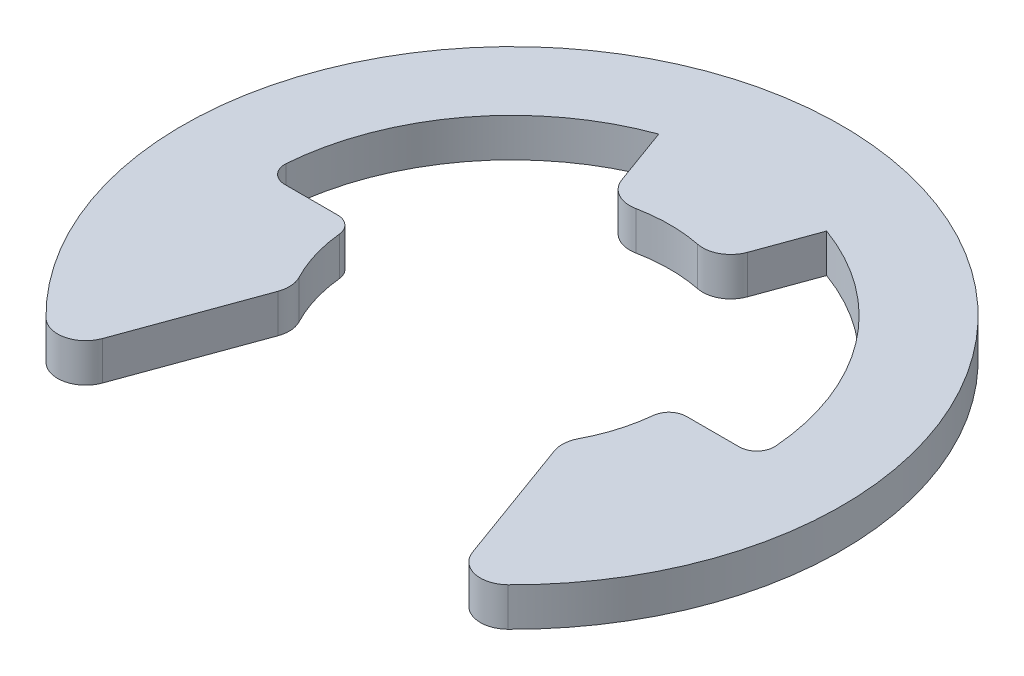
ISO-10303-21;
HEADER;
FILE_DESCRIPTION(('STEP AP214'),'2;1');
FILE_NAME('part.step','',(''),(''),'','','');
FILE_SCHEMA(('AUTOMOTIVE_DESIGN { 1 0 10303 214 1 1 1 1 }'));
ENDSEC;
DATA;
#1=APPLICATION_CONTEXT('core data for automotive mechanical design processes');
#2=APPLICATION_PROTOCOL_DEFINITION('international standard','automotive_design',2000,#1);
#3=PRODUCT_CONTEXT('',#1,'mechanical');
#4=PRODUCT('Part','Part','',(#3));
#5=PRODUCT_RELATED_PRODUCT_CATEGORY('part','',(#4));
#6=PRODUCT_DEFINITION_FORMATION('','',#4);
#7=PRODUCT_DEFINITION_CONTEXT('part definition',#1,'design');
#8=PRODUCT_DEFINITION('design','',#6,#7);
#9=PRODUCT_DEFINITION_SHAPE('','',#8);
#10=(LENGTH_UNIT() NAMED_UNIT(*) SI_UNIT(.MILLI.,.METRE.));
#11=(NAMED_UNIT(*) PLANE_ANGLE_UNIT() SI_UNIT($,.RADIAN.));
#12=(NAMED_UNIT(*) SI_UNIT($,.STERADIAN.) SOLID_ANGLE_UNIT());
#13=UNCERTAINTY_MEASURE_WITH_UNIT(LENGTH_MEASURE(1.E-05),#10,'distance_accuracy_value','');
#14=(GEOMETRIC_REPRESENTATION_CONTEXT(3) GLOBAL_UNCERTAINTY_ASSIGNED_CONTEXT((#13)) GLOBAL_UNIT_ASSIGNED_CONTEXT((#10,
#11,#12)) REPRESENTATION_CONTEXT('',''));
#15=CARTESIAN_POINT('',(0.,0.,0.));
#16=DIRECTION('',(0.,0.,1.));
#17=DIRECTION('',(1.,0.,0.));
#18=AXIS2_PLACEMENT_3D('',#15,#16,#17);
#19=CARTESIAN_POINT('',(0.,0.55,0.));
#20=DIRECTION('',(0.,-1.,0.));
#21=DIRECTION('',(0.,0.,-1.));
#22=AXIS2_PLACEMENT_3D('',#19,#20,#21);
#23=CYLINDRICAL_SURFACE('',#22,7.);
#24=CARTESIAN_POINT('',(0.,0.55,0.));
#25=DIRECTION('',(0.,-1.,0.));
#26=DIRECTION('',(0.,0.,1.));
#27=AXIS2_PLACEMENT_3D('',#24,#25,#26);
#28=CIRCLE('',#27,7.);
#29=CARTESIAN_POINT('',(-6.97925921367,0.55,-0.538461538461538));
#30=VERTEX_POINT('',#29);
#31=CARTESIAN_POINT('',(-2.39414100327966,0.55,-6.57784834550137));
#32=VERTEX_POINT('',#31);
#33=EDGE_CURVE('E187',#30,#32,#28,.T.);
#34=ORIENTED_EDGE('',*,*,#33,.F.);
#35=DIRECTION('',(0.,-1.,0.));
#36=VECTOR('',#35,1.);
#37=CARTESIAN_POINT('',(-6.97925921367,0.55,-0.538461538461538));
#38=LINE('',#37,#36);
#39=CARTESIAN_POINT('',(-6.97925921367,-0.55,-0.538461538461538));
#40=VERTEX_POINT('',#39);
#41=EDGE_CURVE('E327',#30,#40,#38,.T.);
#42=ORIENTED_EDGE('',*,*,#41,.T.);
#43=CARTESIAN_POINT('',(0.,-0.55,0.));
#44=DIRECTION('',(0.,-1.,0.));
#45=DIRECTION('',(0.,0.,1.));
#46=AXIS2_PLACEMENT_3D('',#43,#44,#45);
#47=CIRCLE('',#46,7.);
#48=CARTESIAN_POINT('',(-2.39414100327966,-0.55,-6.57784834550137));
#49=VERTEX_POINT('',#48);
#50=EDGE_CURVE('E211',#40,#49,#47,.T.);
#51=ORIENTED_EDGE('',*,*,#50,.T.);
#52=DIRECTION('',(0.,-1.,0.));
#53=VECTOR('',#52,1.);
#54=CARTESIAN_POINT('',(-2.39414100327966,0.55,-6.57784834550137));
#55=LINE('',#54,#53);
#56=EDGE_CURVE('E204',#32,#49,#55,.T.);
#57=ORIENTED_EDGE('',*,*,#56,.F.);
#58=EDGE_LOOP('',(#34,#42,#51,#57));
#59=FACE_BOUND('',#58,.T.);
#60=ADVANCED_FACE('F39',(#59),#23,.F.);
#61=CARTESIAN_POINT('',(-2.39414100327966,0.55,-6.57784834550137));
#62=DIRECTION('',(0.939692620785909,0.,-0.342020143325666));
#63=DIRECTION('',(-0.342020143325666,0.,-0.93969262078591));
#64=AXIS2_PLACEMENT_3D('',#61,#62,#63);
#65=PLANE('',#64);
#66=DIRECTION('',(0.342020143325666,0.,0.939692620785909));
#67=VECTOR('',#66,1.);
#68=CARTESIAN_POINT('',(-2.39414100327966,-0.55,-6.57784834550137));
#69=LINE('',#68,#67);
#70=CARTESIAN_POINT('',(-1.79193750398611,-0.55,-4.92330782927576));
#71=VERTEX_POINT('',#70);
#72=EDGE_CURVE('E447',#49,#71,#69,.T.);
#73=ORIENTED_EDGE('',*,*,#72,.T.);
#74=DIRECTION('',(0.,-1.,0.));
#75=VECTOR('',#74,1.);
#76=CARTESIAN_POINT('',(-1.79193750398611,0.55,-4.92330782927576));
#77=LINE('',#76,#75);
#78=CARTESIAN_POINT('',(-1.79193750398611,0.55,-4.92330782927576));
#79=VERTEX_POINT('',#78);
#80=EDGE_CURVE('E206',#71,#79,#77,.F.);
#81=ORIENTED_EDGE('',*,*,#80,.T.);
#82=DIRECTION('',(0.342020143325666,0.,0.939692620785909));
#83=VECTOR('',#82,1.);
#84=CARTESIAN_POINT('',(-2.39414100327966,0.55,-6.57784834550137));
#85=LINE('',#84,#83);
#86=EDGE_CURVE('E191',#32,#79,#85,.T.);
#87=ORIENTED_EDGE('',*,*,#86,.F.);
#88=ORIENTED_EDGE('',*,*,#56,.T.);
#89=EDGE_LOOP('',(#73,#81,#87,#88));
#90=FACE_BOUND('',#89,.T.);
#91=ADVANCED_FACE('F203',(#90),#65,.F.);
#92=CARTESIAN_POINT('',(0.,0.55,0.));
#93=DIRECTION('',(0.,-1.,0.));
#94=DIRECTION('',(0.,0.,-1.));
#95=AXIS2_PLACEMENT_3D('',#92,#93,#94);
#96=CYLINDRICAL_SURFACE('',#95,4.5);
#97=CARTESIAN_POINT('',(0.,-0.55,0.));
#98=DIRECTION('',(0.,-1.,0.));
#99=DIRECTION('',(0.,0.,1.));
#100=AXIS2_PLACEMENT_3D('',#97,#98,#99);
#101=CIRCLE('',#100,4.5);
#102=CARTESIAN_POINT('',(-0.883174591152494,-0.55,-4.41248259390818));
#103=VERTEX_POINT('',#102);
#104=CARTESIAN_POINT('',(0.883174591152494,-0.55,-4.41248259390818));
#105=VERTEX_POINT('',#104);
#106=EDGE_CURVE('E449',#103,#105,#101,.T.);
#107=ORIENTED_EDGE('',*,*,#106,.T.);
#108=DIRECTION('',(0.,-1.,0.));
#109=VECTOR('',#108,1.);
#110=CARTESIAN_POINT('',(0.883174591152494,0.55,-4.41248259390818));
#111=LINE('',#110,#109);
#112=CARTESIAN_POINT('',(0.883174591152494,0.55,-4.41248259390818));
#113=VERTEX_POINT('',#112);
#114=EDGE_CURVE('E291',#105,#113,#111,.F.);
#115=ORIENTED_EDGE('',*,*,#114,.T.);
#116=CARTESIAN_POINT('',(0.,0.55,0.));
#117=DIRECTION('',(0.,-1.,0.));
#118=DIRECTION('',(0.,0.,1.));
#119=AXIS2_PLACEMENT_3D('',#116,#117,#118);
#120=CIRCLE('',#119,4.5);
#121=CARTESIAN_POINT('',(-0.883174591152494,0.55,-4.41248259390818));
#122=VERTEX_POINT('',#121);
#123=EDGE_CURVE('E208',#122,#113,#120,.T.);
#124=ORIENTED_EDGE('',*,*,#123,.F.);
#125=DIRECTION('',(0.,-1.,0.));
#126=VECTOR('',#125,1.);
#127=CARTESIAN_POINT('',(-0.883174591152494,0.55,-4.41248259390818));
#128=LINE('',#127,#126);
#129=EDGE_CURVE('E287',#122,#103,#128,.T.);
#130=ORIENTED_EDGE('',*,*,#129,.T.);
#131=EDGE_LOOP('',(#107,#115,#124,#130));
#132=FACE_BOUND('',#131,.T.);
#133=ADVANCED_FACE('F371',(#132),#96,.F.);
#134=CARTESIAN_POINT('',(1.53909064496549,0.55,-4.22861679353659));
#135=DIRECTION('',(-0.939692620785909,0.,-0.342020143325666));
#136=DIRECTION('',(-0.342020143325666,0.,0.93969262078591));
#137=AXIS2_PLACEMENT_3D('',#134,#135,#136);
#138=PLANE('',#137);
#139=DIRECTION('',(0.342020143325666,0.,-0.939692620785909));
#140=VECTOR('',#139,1.);
#141=CARTESIAN_POINT('',(1.53909064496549,0.55,-4.22861679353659));
#142=LINE('',#141,#140);
#143=CARTESIAN_POINT('',(1.79193750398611,0.55,-4.92330782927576));
#144=VERTEX_POINT('',#143);
#145=CARTESIAN_POINT('',(2.39414100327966,0.55,-6.57784834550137));
#146=VERTEX_POINT('',#145);
#147=EDGE_CURVE('E424',#144,#146,#142,.T.);
#148=ORIENTED_EDGE('',*,*,#147,.F.);
#149=DIRECTION('',(0.,-1.,0.));
#150=VECTOR('',#149,1.);
#151=CARTESIAN_POINT('',(1.79193750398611,0.55,-4.92330782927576));
#152=LINE('',#151,#150);
#153=CARTESIAN_POINT('',(1.79193750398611,-0.55,-4.92330782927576));
#154=VERTEX_POINT('',#153);
#155=EDGE_CURVE('E283',#144,#154,#152,.T.);
#156=ORIENTED_EDGE('',*,*,#155,.T.);
#157=DIRECTION('',(0.342020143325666,0.,-0.939692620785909));
#158=VECTOR('',#157,1.);
#159=CARTESIAN_POINT('',(1.53909064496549,-0.55,-4.22861679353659));
#160=LINE('',#159,#158);
#161=CARTESIAN_POINT('',(2.39414100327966,-0.55,-6.57784834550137));
#162=VERTEX_POINT('',#161);
#163=EDGE_CURVE('E453',#154,#162,#160,.T.);
#164=ORIENTED_EDGE('',*,*,#163,.T.);
#165=DIRECTION('',(0.,-1.,0.));
#166=VECTOR('',#165,1.);
#167=CARTESIAN_POINT('',(2.39414100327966,0.55,-6.57784834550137));
#168=LINE('',#167,#166);
#169=EDGE_CURVE('E215',#146,#162,#168,.T.);
#170=ORIENTED_EDGE('',*,*,#169,.F.);
#171=EDGE_LOOP('',(#148,#156,#164,#170));
#172=FACE_BOUND('',#171,.T.);
#173=ADVANCED_FACE('F527',(#172),#138,.F.);
#174=CARTESIAN_POINT('',(0.,0.55,0.));
#175=DIRECTION('',(0.,-1.,0.));
#176=DIRECTION('',(0.,0.,-1.));
#177=AXIS2_PLACEMENT_3D('',#174,#175,#176);
#178=CYLINDRICAL_SURFACE('',#177,7.);
#179=CARTESIAN_POINT('',(0.,-0.55,0.));
#180=DIRECTION('',(0.,-1.,0.));
#181=DIRECTION('',(0.,0.,1.));
#182=AXIS2_PLACEMENT_3D('',#179,#180,#181);
#183=CIRCLE('',#182,7.);
#184=CARTESIAN_POINT('',(6.97925921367,-0.55,-0.538461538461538));
#185=VERTEX_POINT('',#184);
#186=EDGE_CURVE('E456',#162,#185,#183,.T.);
#187=ORIENTED_EDGE('',*,*,#186,.T.);
#188=DIRECTION('',(0.,-1.,0.));
#189=VECTOR('',#188,1.);
#190=CARTESIAN_POINT('',(6.97925921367,0.55,-0.538461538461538));
#191=LINE('',#190,#189);
#192=CARTESIAN_POINT('',(6.97925921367,0.55,-0.538461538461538));
#193=VERTEX_POINT('',#192);
#194=EDGE_CURVE('E309',#185,#193,#191,.F.);
#195=ORIENTED_EDGE('',*,*,#194,.T.);
#196=CARTESIAN_POINT('',(0.,0.55,0.));
#197=DIRECTION('',(0.,-1.,0.));
#198=DIRECTION('',(0.,0.,1.));
#199=AXIS2_PLACEMENT_3D('',#196,#197,#198);
#200=CIRCLE('',#199,7.);
#201=EDGE_CURVE('E411',#146,#193,#200,.T.);
#202=ORIENTED_EDGE('',*,*,#201,.F.);
#203=ORIENTED_EDGE('',*,*,#169,.T.);
#204=EDGE_LOOP('',(#187,#195,#202,#203));
#205=FACE_BOUND('',#204,.T.);
#206=ADVANCED_FACE('F521',(#205),#178,.F.);
#207=CARTESIAN_POINT('',(4.5,0.55,0.));
#208=DIRECTION('',(0.,0.,1.));
#209=DIRECTION('',(1.,0.,0.));
#210=AXIS2_PLACEMENT_3D('',#207,#208,#209);
#211=PLANE('',#210);
#212=DIRECTION('',(-1.,0.,0.));
#213=VECTOR('',#212,1.);
#214=CARTESIAN_POINT('',(4.5,0.55,0.));
#215=LINE('',#214,#213);
#216=CARTESIAN_POINT('',(6.48074069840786,0.55,0.));
#217=VERTEX_POINT('',#216);
#218=CARTESIAN_POINT('',(4.9749371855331,0.55,0.));
#219=VERTEX_POINT('',#218);
#220=EDGE_CURVE('E408',#217,#219,#215,.T.);
#221=ORIENTED_EDGE('',*,*,#220,.F.);
#222=DIRECTION('',(0.,1.,0.));
#223=VECTOR('',#222,1.);
#224=CARTESIAN_POINT('',(6.48074069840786,-0.55,0.));
#225=LINE('',#224,#223);
#226=CARTESIAN_POINT('',(6.48074069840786,-0.55,0.));
#227=VERTEX_POINT('',#226);
#228=EDGE_CURVE('E305',#217,#227,#225,.F.);
#229=ORIENTED_EDGE('',*,*,#228,.T.);
#230=DIRECTION('',(-1.,0.,0.));
#231=VECTOR('',#230,1.);
#232=CARTESIAN_POINT('',(4.5,-0.55,0.));
#233=LINE('',#232,#231);
#234=CARTESIAN_POINT('',(4.9749371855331,-0.55,0.));
#235=VERTEX_POINT('',#234);
#236=EDGE_CURVE('E460',#227,#235,#233,.T.);
#237=ORIENTED_EDGE('',*,*,#236,.T.);
#238=DIRECTION('',(0.,-1.,0.));
#239=VECTOR('',#238,1.);
#240=CARTESIAN_POINT('',(4.9749371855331,0.55,0.));
#241=LINE('',#240,#239);
#242=EDGE_CURVE('E303',#235,#219,#241,.F.);
#243=ORIENTED_EDGE('',*,*,#242,.T.);
#244=EDGE_LOOP('',(#221,#229,#237,#243));
#245=FACE_BOUND('',#244,.T.);
#246=ADVANCED_FACE('F413',(#245),#211,.F.);
#247=CARTESIAN_POINT('',(0.,0.55,0.));
#248=DIRECTION('',(0.,-1.,0.));
#249=DIRECTION('',(0.,0.,-1.));
#250=AXIS2_PLACEMENT_3D('',#247,#248,#249);
#251=CYLINDRICAL_SURFACE('',#250,4.5);
#252=CARTESIAN_POINT('',(0.,0.55,0.));
#253=DIRECTION('',(0.,-1.,0.));
#254=DIRECTION('',(0.,0.,1.));
#255=AXIS2_PLACEMENT_3D('',#252,#253,#254);
#256=CIRCLE('',#255,4.5);
#257=CARTESIAN_POINT('',(4.47744346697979,0.55,0.45));
#258=VERTEX_POINT('',#257);
#259=CARTESIAN_POINT('',(3.98517922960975,0.55,2.09005897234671));
#260=VERTEX_POINT('',#259);
#261=EDGE_CURVE('E418',#258,#260,#256,.T.);
#262=ORIENTED_EDGE('',*,*,#261,.F.);
#263=DIRECTION('',(0.,-1.,0.));
#264=VECTOR('',#263,1.);
#265=CARTESIAN_POINT('',(4.47744346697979,0.55,0.45));
#266=LINE('',#265,#264);
#267=CARTESIAN_POINT('',(4.47744346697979,-0.55,0.45));
#268=VERTEX_POINT('',#267);
#269=EDGE_CURVE('E312',#258,#268,#266,.T.);
#270=ORIENTED_EDGE('',*,*,#269,.T.);
#271=CARTESIAN_POINT('',(0.,-0.55,0.));
#272=DIRECTION('',(0.,-1.,0.));
#273=DIRECTION('',(0.,0.,1.));
#274=AXIS2_PLACEMENT_3D('',#271,#272,#273);
#275=CIRCLE('',#274,4.5);
#276=CARTESIAN_POINT('',(3.98517922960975,-0.55,2.09005897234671));
#277=VERTEX_POINT('',#276);
#278=EDGE_CURVE('E463',#268,#277,#275,.T.);
#279=ORIENTED_EDGE('',*,*,#278,.T.);
#280=DIRECTION('',(0.,-1.,0.));
#281=VECTOR('',#280,1.);
#282=CARTESIAN_POINT('',(3.98517922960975,0.55,2.09005897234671));
#283=LINE('',#282,#281);
#284=EDGE_CURVE('E250',#277,#260,#283,.F.);
#285=ORIENTED_EDGE('',*,*,#284,.T.);
#286=EDGE_LOOP('',(#262,#270,#279,#285));
#287=FACE_BOUND('',#286,.T.);
#288=ADVANCED_FACE('F512',(#287),#251,.F.);
#289=CARTESIAN_POINT('',(3.81499999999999,0.55,2.38658228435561));
#290=DIRECTION('',(0.939692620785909,0.,-0.342020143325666));
#291=DIRECTION('',(-0.342020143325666,0.,-0.939692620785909));
#292=AXIS2_PLACEMENT_3D('',#289,#290,#291);
#293=PLANE('',#292);
#294=DIRECTION('',(0.342020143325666,0.,0.939692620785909));
#295=VECTOR('',#294,1.);
#296=CARTESIAN_POINT('',(3.81499999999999,0.55,2.38658228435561));
#297=LINE('',#296,#295);
#298=CARTESIAN_POINT('',(3.94190144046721,0.55,2.73524112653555));
#299=VERTEX_POINT('',#298);
#300=CARTESIAN_POINT('',(5.27787312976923,0.55,6.40579317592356));
#301=VERTEX_POINT('',#300);
#302=EDGE_CURVE('E421',#299,#301,#297,.T.);
#303=ORIENTED_EDGE('',*,*,#302,.F.);
#304=DIRECTION('',(0.,-1.,0.));
#305=VECTOR('',#304,1.);
#306=CARTESIAN_POINT('',(3.94190144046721,0.55,2.73524112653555));
#307=LINE('',#306,#305);
#308=CARTESIAN_POINT('',(3.94190144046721,-0.55,2.73524112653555));
#309=VERTEX_POINT('',#308);
#310=EDGE_CURVE('E220',#299,#309,#307,.T.);
#311=ORIENTED_EDGE('',*,*,#310,.T.);
#312=DIRECTION('',(0.342020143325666,0.,0.939692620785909));
#313=VECTOR('',#312,1.);
#314=CARTESIAN_POINT('',(3.81499999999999,-0.55,2.38658228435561));
#315=LINE('',#314,#313);
#316=CARTESIAN_POINT('',(5.27787312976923,-0.55,6.40579317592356));
#317=VERTEX_POINT('',#316);
#318=EDGE_CURVE('E466',#309,#317,#315,.T.);
#319=ORIENTED_EDGE('',*,*,#318,.T.);
#320=DIRECTION('',(0.,-1.,0.));
#321=VECTOR('',#320,1.);
#322=CARTESIAN_POINT('',(5.27787312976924,0.55,6.40579317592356));
#323=LINE('',#322,#321);
#324=EDGE_CURVE('E214',#317,#301,#323,.F.);
#325=ORIENTED_EDGE('',*,*,#324,.T.);
#326=EDGE_LOOP('',(#303,#311,#319,#325));
#327=FACE_BOUND('',#326,.T.);
#328=ADVANCED_FACE('F506',(#327),#293,.F.);
#329=CARTESIAN_POINT('',(0.,0.55,0.));
#330=DIRECTION('',(0.,-1.,0.));
#331=DIRECTION('',(0.,0.,-1.));
#332=AXIS2_PLACEMENT_3D('',#329,#330,#331);
#333=CYLINDRICAL_SURFACE('',#332,9.4);
#334=CARTESIAN_POINT('',(0.,0.55,0.));
#335=DIRECTION('',(0.,1.,0.));
#336=DIRECTION('',(0.,0.,1.));
#337=AXIS2_PLACEMENT_3D('',#334,#335,#336);
#338=CIRCLE('',#337,9.4);
#339=CARTESIAN_POINT('',(6.59052278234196,0.55,6.70261213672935));
#340=VERTEX_POINT('',#339);
#341=CARTESIAN_POINT('',(-6.590522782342,0.55,6.70261213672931));
#342=VERTEX_POINT('',#341);
#343=EDGE_CURVE('E431',#340,#342,#338,.T.);
#344=ORIENTED_EDGE('',*,*,#343,.F.);
#345=DIRECTION('',(0.,-1.,0.));
#346=VECTOR('',#345,1.);
#347=CARTESIAN_POINT('',(6.59052278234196,0.55,6.70261213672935));
#348=LINE('',#347,#346);
#349=CARTESIAN_POINT('',(6.59052278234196,-0.55,6.70261213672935));
#350=VERTEX_POINT('',#349);
#351=EDGE_CURVE('E299',#340,#350,#348,.T.);
#352=ORIENTED_EDGE('',*,*,#351,.T.);
#353=CARTESIAN_POINT('',(0.,-0.55,0.));
#354=DIRECTION('',(0.,1.,0.));
#355=DIRECTION('',(0.,0.,1.));
#356=AXIS2_PLACEMENT_3D('',#353,#354,#355);
#357=CIRCLE('',#356,9.4);
#358=CARTESIAN_POINT('',(-6.590522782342,-0.55,6.70261213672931));
#359=VERTEX_POINT('',#358);
#360=EDGE_CURVE('E470',#350,#359,#357,.T.);
#361=ORIENTED_EDGE('',*,*,#360,.T.);
#362=DIRECTION('',(0.,-1.,0.));
#363=VECTOR('',#362,1.);
#364=CARTESIAN_POINT('',(-6.590522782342,0.55,6.70261213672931));
#365=LINE('',#364,#363);
#366=EDGE_CURVE('E296',#359,#342,#365,.F.);
#367=ORIENTED_EDGE('',*,*,#366,.T.);
#368=EDGE_LOOP('',(#344,#352,#361,#367));
#369=FACE_BOUND('',#368,.T.);
#370=ADVANCED_FACE('F499',(#369),#333,.T.);
#371=CARTESIAN_POINT('',(-5.67406753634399,0.55,7.49432836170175));
#372=DIRECTION('',(-0.939692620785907,0.,-0.342020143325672));
#373=DIRECTION('',(-0.342020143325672,0.,0.939692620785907));
#374=AXIS2_PLACEMENT_3D('',#371,#372,#373);
#375=PLANE('',#374);
#376=DIRECTION('',(0.342020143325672,0.,-0.939692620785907));
#377=VECTOR('',#376,1.);
#378=CARTESIAN_POINT('',(-5.67406753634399,-0.55,7.49432836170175));
#379=LINE('',#378,#377);
#380=CARTESIAN_POINT('',(-5.27787312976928,-0.55,6.40579317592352));
#381=VERTEX_POINT('',#380);
#382=CARTESIAN_POINT('',(-3.94190144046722,-0.55,2.73524112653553));
#383=VERTEX_POINT('',#382);
#384=EDGE_CURVE('E474',#381,#383,#379,.T.);
#385=ORIENTED_EDGE('',*,*,#384,.T.);
#386=DIRECTION('',(0.,-1.,0.));
#387=VECTOR('',#386,1.);
#388=CARTESIAN_POINT('',(-3.94190144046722,0.55,2.73524112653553));
#389=LINE('',#388,#387);
#390=CARTESIAN_POINT('',(-3.94190144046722,0.55,2.73524112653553));
#391=VERTEX_POINT('',#390);
#392=EDGE_CURVE('E280',#383,#391,#389,.F.);
#393=ORIENTED_EDGE('',*,*,#392,.T.);
#394=DIRECTION('',(0.342020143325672,0.,-0.939692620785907));
#395=VECTOR('',#394,1.);
#396=CARTESIAN_POINT('',(-5.67406753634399,0.55,7.49432836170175));
#397=LINE('',#396,#395);
#398=CARTESIAN_POINT('',(-5.27787312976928,0.55,6.40579317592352));
#399=VERTEX_POINT('',#398);
#400=EDGE_CURVE('E435',#399,#391,#397,.T.);
#401=ORIENTED_EDGE('',*,*,#400,.F.);
#402=DIRECTION('',(0.,-1.,0.));
#403=VECTOR('',#402,1.);
#404=CARTESIAN_POINT('',(-5.27787312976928,0.55,6.40579317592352));
#405=LINE('',#404,#403);
#406=EDGE_CURVE('E276',#399,#381,#405,.T.);
#407=ORIENTED_EDGE('',*,*,#406,.T.);
#408=EDGE_LOOP('',(#385,#393,#401,#407));
#409=FACE_BOUND('',#408,.T.);
#410=ADVANCED_FACE('F491',(#409),#375,.F.);
#411=CARTESIAN_POINT('',(0.,0.55,0.));
#412=DIRECTION('',(0.,-1.,0.));
#413=DIRECTION('',(0.,0.,-1.));
#414=AXIS2_PLACEMENT_3D('',#411,#412,#413);
#415=CYLINDRICAL_SURFACE('',#414,4.5);
#416=CARTESIAN_POINT('',(0.,-0.55,0.));
#417=DIRECTION('',(0.,-1.,0.));
#418=DIRECTION('',(0.,0.,1.));
#419=AXIS2_PLACEMENT_3D('',#416,#417,#418);
#420=CIRCLE('',#419,4.5);
#421=CARTESIAN_POINT('',(-3.98517922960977,-0.55,2.09005897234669));
#422=VERTEX_POINT('',#421);
#423=CARTESIAN_POINT('',(-4.47744346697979,-0.55,0.45));
#424=VERTEX_POINT('',#423);
#425=EDGE_CURVE('E354',#422,#424,#420,.T.);
#426=ORIENTED_EDGE('',*,*,#425,.T.);
#427=DIRECTION('',(0.,-1.,0.));
#428=VECTOR('',#427,1.);
#429=CARTESIAN_POINT('',(-4.47744346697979,0.55,0.45));
#430=LINE('',#429,#428);
#431=CARTESIAN_POINT('',(-4.47744346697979,0.55,0.45));
#432=VERTEX_POINT('',#431);
#433=EDGE_CURVE('E336',#424,#432,#430,.F.);
#434=ORIENTED_EDGE('',*,*,#433,.T.);
#435=CARTESIAN_POINT('',(0.,0.55,0.));
#436=DIRECTION('',(0.,-1.,0.));
#437=DIRECTION('',(0.,0.,1.));
#438=AXIS2_PLACEMENT_3D('',#435,#436,#437);
#439=CIRCLE('',#438,4.5);
#440=CARTESIAN_POINT('',(-3.98517922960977,0.55,2.09005897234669));
#441=VERTEX_POINT('',#440);
#442=EDGE_CURVE('E439',#441,#432,#439,.T.);
#443=ORIENTED_EDGE('',*,*,#442,.F.);
#444=DIRECTION('',(0.,-1.,0.));
#445=VECTOR('',#444,1.);
#446=CARTESIAN_POINT('',(-3.98517922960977,0.55,2.09005897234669));
#447=LINE('',#446,#445);
#448=EDGE_CURVE('E272',#441,#422,#447,.T.);
#449=ORIENTED_EDGE('',*,*,#448,.T.);
#450=EDGE_LOOP('',(#426,#434,#443,#449));
#451=FACE_BOUND('',#450,.T.);
#452=ADVANCED_FACE('F483',(#451),#415,.F.);
#453=CARTESIAN_POINT('',(-4.5,0.55,0.));
#454=DIRECTION('',(0.,0.,1.));
#455=DIRECTION('',(1.,0.,0.));
#456=AXIS2_PLACEMENT_3D('',#453,#454,#455);
#457=PLANE('',#456);
#458=DIRECTION('',(-1.,0.,0.));
#459=VECTOR('',#458,1.);
#460=CARTESIAN_POINT('',(-4.5,-0.55,0.));
#461=LINE('',#460,#459);
#462=CARTESIAN_POINT('',(-4.9749371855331,-0.55,0.));
#463=VERTEX_POINT('',#462);
#464=CARTESIAN_POINT('',(-6.48074069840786,-0.55,0.));
#465=VERTEX_POINT('',#464);
#466=EDGE_CURVE('E198',#463,#465,#461,.T.);
#467=ORIENTED_EDGE('',*,*,#466,.T.);
#468=DIRECTION('',(0.,1.,0.));
#469=VECTOR('',#468,1.);
#470=CARTESIAN_POINT('',(-6.48074069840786,0.55,0.));
#471=LINE('',#470,#469);
#472=CARTESIAN_POINT('',(-6.48074069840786,0.55,0.));
#473=VERTEX_POINT('',#472);
#474=EDGE_CURVE('E61',#465,#473,#471,.T.);
#475=ORIENTED_EDGE('',*,*,#474,.T.);
#476=DIRECTION('',(-1.,0.,0.));
#477=VECTOR('',#476,1.);
#478=CARTESIAN_POINT('',(-4.5,0.55,0.));
#479=LINE('',#478,#477);
#480=CARTESIAN_POINT('',(-4.9749371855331,0.55,0.));
#481=VERTEX_POINT('',#480);
#482=EDGE_CURVE('E224',#481,#473,#479,.T.);
#483=ORIENTED_EDGE('',*,*,#482,.F.);
#484=DIRECTION('',(0.,-1.,0.));
#485=VECTOR('',#484,1.);
#486=CARTESIAN_POINT('',(-4.9749371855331,0.55,0.));
#487=LINE('',#486,#485);
#488=EDGE_CURVE('E330',#481,#463,#487,.T.);
#489=ORIENTED_EDGE('',*,*,#488,.T.);
#490=EDGE_LOOP('',(#467,#475,#483,#489));
#491=FACE_BOUND('',#490,.T.);
#492=ADVANCED_FACE('F351',(#491),#457,.F.);
#493=CARTESIAN_POINT('',(0.,0.55,0.));
#494=DIRECTION('',(0.,1.,0.));
#495=DIRECTION('',(0.,0.,1.));
#496=AXIS2_PLACEMENT_3D('',#493,#494,#495);
#497=PLANE('',#496);
#498=ORIENTED_EDGE('',*,*,#220,.T.);
#499=CARTESIAN_POINT('',(4.9749371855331,0.55,0.5));
#500=DIRECTION('',(0.,1.,0.));
#501=DIRECTION('',(0.,0.,1.));
#502=AXIS2_PLACEMENT_3D('',#499,#500,#501);
#503=CIRCLE('',#502,0.5);
#504=EDGE_CURVE('E324',#219,#258,#503,.T.);
#505=ORIENTED_EDGE('',*,*,#504,.T.);
#506=ORIENTED_EDGE('',*,*,#261,.T.);
#507=CARTESIAN_POINT('',(4.69365553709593,0.55,2.46162501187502));
#508=DIRECTION('',(0.,1.,0.));
#509=DIRECTION('',(0.,0.,1.));
#510=AXIS2_PLACEMENT_3D('',#507,#508,#509);
#511=CIRCLE('',#510,0.8);
#512=EDGE_CURVE('E269',#260,#299,#511,.T.);
#513=ORIENTED_EDGE('',*,*,#512,.T.);
#514=ORIENTED_EDGE('',*,*,#302,.T.);
#515=CARTESIAN_POINT('',(6.02962722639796,0.55,6.13217706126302));
#516=DIRECTION('',(0.,1.,0.));
#517=DIRECTION('',(0.,0.,1.));
#518=AXIS2_PLACEMENT_3D('',#515,#516,#517);
#519=CIRCLE('',#518,0.8);
#520=EDGE_CURVE('E257',#301,#340,#519,.T.);
#521=ORIENTED_EDGE('',*,*,#520,.T.);
#522=ORIENTED_EDGE('',*,*,#343,.T.);
#523=CARTESIAN_POINT('',(-6.029627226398,0.55,6.13217706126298));
#524=DIRECTION('',(0.,1.,0.));
#525=DIRECTION('',(0.,0.,1.));
#526=AXIS2_PLACEMENT_3D('',#523,#524,#525);
#527=CIRCLE('',#526,0.8);
#528=EDGE_CURVE('E254',#342,#399,#527,.T.);
#529=ORIENTED_EDGE('',*,*,#528,.T.);
#530=ORIENTED_EDGE('',*,*,#400,.T.);
#531=CARTESIAN_POINT('',(-4.69365553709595,0.55,2.46162501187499));
#532=DIRECTION('',(0.,1.,0.));
#533=DIRECTION('',(0.,0.,1.));
#534=AXIS2_PLACEMENT_3D('',#531,#532,#533);
#535=CIRCLE('',#534,0.8);
#536=EDGE_CURVE('E266',#391,#441,#535,.T.);
#537=ORIENTED_EDGE('',*,*,#536,.T.);
#538=ORIENTED_EDGE('',*,*,#442,.T.);
#539=CARTESIAN_POINT('',(-4.9749371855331,0.55,0.5));
#540=DIRECTION('',(0.,1.,0.));
#541=DIRECTION('',(0.,0.,1.));
#542=AXIS2_PLACEMENT_3D('',#539,#540,#541);
#543=CIRCLE('',#542,0.5);
#544=EDGE_CURVE('E322',#432,#481,#543,.T.);
#545=ORIENTED_EDGE('',*,*,#544,.T.);
#546=ORIENTED_EDGE('',*,*,#482,.T.);
#547=CARTESIAN_POINT('',(-6.48074069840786,0.55,-0.5));
#548=DIRECTION('',(0.,1.,0.));
#549=DIRECTION('',(0.,0.,1.));
#550=AXIS2_PLACEMENT_3D('',#547,#548,#549);
#551=CIRCLE('',#550,0.5);
#552=EDGE_CURVE('E11',#473,#30,#551,.F.);
#553=ORIENTED_EDGE('',*,*,#552,.T.);
#554=ORIENTED_EDGE('',*,*,#33,.T.);
#555=ORIENTED_EDGE('',*,*,#86,.T.);
#556=CARTESIAN_POINT('',(-1.04018340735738,0.55,-5.1969239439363));
#557=DIRECTION('',(0.,1.,0.));
#558=DIRECTION('',(0.,0.,1.));
#559=AXIS2_PLACEMENT_3D('',#556,#557,#558);
#560=CIRCLE('',#559,0.8);
#561=EDGE_CURVE('E260',#79,#122,#560,.T.);
#562=ORIENTED_EDGE('',*,*,#561,.T.);
#563=ORIENTED_EDGE('',*,*,#123,.T.);
#564=CARTESIAN_POINT('',(1.04018340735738,0.55,-5.1969239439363));
#565=DIRECTION('',(0.,1.,0.));
#566=DIRECTION('',(0.,0.,1.));
#567=AXIS2_PLACEMENT_3D('',#564,#565,#566);
#568=CIRCLE('',#567,0.8);
#569=EDGE_CURVE('E263',#113,#144,#568,.T.);
#570=ORIENTED_EDGE('',*,*,#569,.T.);
#571=ORIENTED_EDGE('',*,*,#147,.T.);
#572=ORIENTED_EDGE('',*,*,#201,.T.);
#573=CARTESIAN_POINT('',(6.48074069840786,0.55,-0.5));
#574=DIRECTION('',(0.,1.,0.));
#575=DIRECTION('',(0.,0.,1.));
#576=AXIS2_PLACEMENT_3D('',#573,#574,#575);
#577=CIRCLE('',#576,0.5);
#578=EDGE_CURVE('E342',#193,#217,#577,.F.);
#579=ORIENTED_EDGE('',*,*,#578,.T.);
#580=EDGE_LOOP('',(#498,#505,#506,#513,#514,#521,#522,#529,#530,#537,#538,#545,#546,#553,#554,
#555,#562,#563,#570,#571,#572,#579));
#581=FACE_BOUND('',#580,.T.);
#582=ADVANCED_FACE('F190',(#581),#497,.T.);
#583=CARTESIAN_POINT('',(0.,-0.55,0.));
#584=DIRECTION('',(0.,1.,0.));
#585=DIRECTION('',(0.,0.,1.));
#586=AXIS2_PLACEMENT_3D('',#583,#584,#585);
#587=PLANE('',#586);
#588=ORIENTED_EDGE('',*,*,#278,.F.);
#589=CARTESIAN_POINT('',(4.9749371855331,-0.55,0.5));
#590=DIRECTION('',(0.,1.,0.));
#591=DIRECTION('',(0.,0.,1.));
#592=AXIS2_PLACEMENT_3D('',#589,#590,#591);
#593=CIRCLE('',#592,0.5);
#594=EDGE_CURVE('E319',#268,#235,#593,.F.);
#595=ORIENTED_EDGE('',*,*,#594,.T.);
#596=ORIENTED_EDGE('',*,*,#236,.F.);
#597=CARTESIAN_POINT('',(6.48074069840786,-0.55,-0.5));
#598=DIRECTION('',(0.,1.,0.));
#599=DIRECTION('',(0.,0.,1.));
#600=AXIS2_PLACEMENT_3D('',#597,#598,#599);
#601=CIRCLE('',#600,0.5);
#602=EDGE_CURVE('E339',#227,#185,#601,.T.);
#603=ORIENTED_EDGE('',*,*,#602,.T.);
#604=ORIENTED_EDGE('',*,*,#186,.F.);
#605=ORIENTED_EDGE('',*,*,#163,.F.);
#606=CARTESIAN_POINT('',(1.04018340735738,-0.55,-5.1969239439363));
#607=DIRECTION('',(0.,1.,0.));
#608=DIRECTION('',(0.,0.,1.));
#609=AXIS2_PLACEMENT_3D('',#606,#607,#608);
#610=CIRCLE('',#609,0.8);
#611=EDGE_CURVE('E240',#154,#105,#610,.F.);
#612=ORIENTED_EDGE('',*,*,#611,.T.);
#613=ORIENTED_EDGE('',*,*,#106,.F.);
#614=CARTESIAN_POINT('',(-1.04018340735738,-0.55,-5.1969239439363));
#615=DIRECTION('',(0.,1.,0.));
#616=DIRECTION('',(0.,0.,1.));
#617=AXIS2_PLACEMENT_3D('',#614,#615,#616);
#618=CIRCLE('',#617,0.8);
#619=EDGE_CURVE('E237',#103,#71,#618,.F.);
#620=ORIENTED_EDGE('',*,*,#619,.T.);
#621=ORIENTED_EDGE('',*,*,#72,.F.);
#622=ORIENTED_EDGE('',*,*,#50,.F.);
#623=CARTESIAN_POINT('',(-6.48074069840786,-0.55,-0.5));
#624=DIRECTION('',(0.,1.,0.));
#625=DIRECTION('',(0.,0.,1.));
#626=AXIS2_PLACEMENT_3D('',#623,#624,#625);
#627=CIRCLE('',#626,0.5);
#628=EDGE_CURVE('E48',#40,#465,#627,.T.);
#629=ORIENTED_EDGE('',*,*,#628,.T.);
#630=ORIENTED_EDGE('',*,*,#466,.F.);
#631=CARTESIAN_POINT('',(-4.9749371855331,-0.55,0.5));
#632=DIRECTION('',(0.,1.,0.));
#633=DIRECTION('',(0.,0.,1.));
#634=AXIS2_PLACEMENT_3D('',#631,#632,#633);
#635=CIRCLE('',#634,0.5);
#636=EDGE_CURVE('E316',#463,#424,#635,.F.);
#637=ORIENTED_EDGE('',*,*,#636,.T.);
#638=ORIENTED_EDGE('',*,*,#425,.F.);
#639=CARTESIAN_POINT('',(-4.69365553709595,-0.55,2.46162501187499));
#640=DIRECTION('',(0.,1.,0.));
#641=DIRECTION('',(0.,0.,1.));
#642=AXIS2_PLACEMENT_3D('',#639,#640,#641);
#643=CIRCLE('',#642,0.8);
#644=EDGE_CURVE('E243',#422,#383,#643,.F.);
#645=ORIENTED_EDGE('',*,*,#644,.T.);
#646=ORIENTED_EDGE('',*,*,#384,.F.);
#647=CARTESIAN_POINT('',(-6.029627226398,-0.55,6.13217706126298));
#648=DIRECTION('',(0.,1.,0.));
#649=DIRECTION('',(0.,0.,1.));
#650=AXIS2_PLACEMENT_3D('',#647,#648,#649);
#651=CIRCLE('',#650,0.8);
#652=EDGE_CURVE('E231',#381,#359,#651,.F.);
#653=ORIENTED_EDGE('',*,*,#652,.T.);
#654=ORIENTED_EDGE('',*,*,#360,.F.);
#655=CARTESIAN_POINT('',(6.02962722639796,-0.55,6.13217706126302));
#656=DIRECTION('',(0.,1.,0.));
#657=DIRECTION('',(0.,0.,1.));
#658=AXIS2_PLACEMENT_3D('',#655,#656,#657);
#659=CIRCLE('',#658,0.8);
#660=EDGE_CURVE('E234',#350,#317,#659,.F.);
#661=ORIENTED_EDGE('',*,*,#660,.T.);
#662=ORIENTED_EDGE('',*,*,#318,.F.);
#663=CARTESIAN_POINT('',(4.69365553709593,-0.55,2.46162501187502));
#664=DIRECTION('',(0.,1.,0.));
#665=DIRECTION('',(0.,0.,1.));
#666=AXIS2_PLACEMENT_3D('',#663,#664,#665);
#667=CIRCLE('',#666,0.8);
#668=EDGE_CURVE('E246',#309,#277,#667,.F.);
#669=ORIENTED_EDGE('',*,*,#668,.T.);
#670=EDGE_LOOP('',(#588,#595,#596,#603,#604,#605,#612,#613,#620,#621,#622,#629,#630,#637,#638,
#645,#646,#653,#654,#661,#662,#669));
#671=FACE_BOUND('',#670,.T.);
#672=ADVANCED_FACE('F349',(#671),#587,.F.);
#673=CARTESIAN_POINT('',(4.69365553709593,0.55,2.46162501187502));
#674=DIRECTION('',(0.,-1.,0.));
#675=DIRECTION('',(0.,0.,-1.));
#676=AXIS2_PLACEMENT_3D('',#673,#674,#675);
#677=CYLINDRICAL_SURFACE('',#676,0.8);
#678=ORIENTED_EDGE('',*,*,#512,.F.);
#679=ORIENTED_EDGE('',*,*,#284,.F.);
#680=ORIENTED_EDGE('',*,*,#668,.F.);
#681=ORIENTED_EDGE('',*,*,#310,.F.);
#682=EDGE_LOOP('',(#678,#679,#680,#681));
#683=FACE_BOUND('',#682,.T.);
#684=ADVANCED_FACE('F375',(#683),#677,.T.);
#685=CARTESIAN_POINT('',(-4.69365553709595,0.55,2.46162501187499));
#686=DIRECTION('',(0.,-1.,0.));
#687=DIRECTION('',(0.,0.,-1.));
#688=AXIS2_PLACEMENT_3D('',#685,#686,#687);
#689=CYLINDRICAL_SURFACE('',#688,0.8);
#690=ORIENTED_EDGE('',*,*,#536,.F.);
#691=ORIENTED_EDGE('',*,*,#392,.F.);
#692=ORIENTED_EDGE('',*,*,#644,.F.);
#693=ORIENTED_EDGE('',*,*,#448,.F.);
#694=EDGE_LOOP('',(#690,#691,#692,#693));
#695=FACE_BOUND('',#694,.T.);
#696=ADVANCED_FACE('F378',(#695),#689,.T.);
#697=CARTESIAN_POINT('',(1.04018340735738,0.55,-5.1969239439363));
#698=DIRECTION('',(0.,-1.,0.));
#699=DIRECTION('',(0.,0.,-1.));
#700=AXIS2_PLACEMENT_3D('',#697,#698,#699);
#701=CYLINDRICAL_SURFACE('',#700,0.8);
#702=ORIENTED_EDGE('',*,*,#569,.F.);
#703=ORIENTED_EDGE('',*,*,#114,.F.);
#704=ORIENTED_EDGE('',*,*,#611,.F.);
#705=ORIENTED_EDGE('',*,*,#155,.F.);
#706=EDGE_LOOP('',(#702,#703,#704,#705));
#707=FACE_BOUND('',#706,.T.);
#708=ADVANCED_FACE('F382',(#707),#701,.T.);
#709=CARTESIAN_POINT('',(-1.04018340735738,0.55,-5.1969239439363));
#710=DIRECTION('',(0.,-1.,0.));
#711=DIRECTION('',(0.,0.,-1.));
#712=AXIS2_PLACEMENT_3D('',#709,#710,#711);
#713=CYLINDRICAL_SURFACE('',#712,0.8);
#714=ORIENTED_EDGE('',*,*,#561,.F.);
#715=ORIENTED_EDGE('',*,*,#80,.F.);
#716=ORIENTED_EDGE('',*,*,#619,.F.);
#717=ORIENTED_EDGE('',*,*,#129,.F.);
#718=EDGE_LOOP('',(#714,#715,#716,#717));
#719=FACE_BOUND('',#718,.T.);
#720=ADVANCED_FACE('F386',(#719),#713,.T.);
#721=CARTESIAN_POINT('',(6.02962722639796,0.55,6.13217706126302));
#722=DIRECTION('',(0.,-1.,0.));
#723=DIRECTION('',(0.,0.,-1.));
#724=AXIS2_PLACEMENT_3D('',#721,#722,#723);
#725=CYLINDRICAL_SURFACE('',#724,0.8);
#726=ORIENTED_EDGE('',*,*,#520,.F.);
#727=ORIENTED_EDGE('',*,*,#324,.F.);
#728=ORIENTED_EDGE('',*,*,#660,.F.);
#729=ORIENTED_EDGE('',*,*,#351,.F.);
#730=EDGE_LOOP('',(#726,#727,#728,#729));
#731=FACE_BOUND('',#730,.T.);
#732=ADVANCED_FACE('F390',(#731),#725,.T.);
#733=CARTESIAN_POINT('',(-6.029627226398,0.55,6.13217706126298));
#734=DIRECTION('',(0.,-1.,0.));
#735=DIRECTION('',(0.,0.,-1.));
#736=AXIS2_PLACEMENT_3D('',#733,#734,#735);
#737=CYLINDRICAL_SURFACE('',#736,0.8);
#738=ORIENTED_EDGE('',*,*,#528,.F.);
#739=ORIENTED_EDGE('',*,*,#366,.F.);
#740=ORIENTED_EDGE('',*,*,#652,.F.);
#741=ORIENTED_EDGE('',*,*,#406,.F.);
#742=EDGE_LOOP('',(#738,#739,#740,#741));
#743=FACE_BOUND('',#742,.T.);
#744=ADVANCED_FACE('F394',(#743),#737,.T.);
#745=CARTESIAN_POINT('',(6.48074069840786,0.55,-0.5));
#746=DIRECTION('',(0.,-1.,0.));
#747=DIRECTION('',(0.,0.,-1.));
#748=AXIS2_PLACEMENT_3D('',#745,#746,#747);
#749=CYLINDRICAL_SURFACE('',#748,0.5);
#750=ORIENTED_EDGE('',*,*,#578,.F.);
#751=ORIENTED_EDGE('',*,*,#194,.F.);
#752=ORIENTED_EDGE('',*,*,#602,.F.);
#753=ORIENTED_EDGE('',*,*,#228,.F.);
#754=EDGE_LOOP('',(#750,#751,#752,#753));
#755=FACE_BOUND('',#754,.T.);
#756=ADVANCED_FACE('F363',(#755),#749,.F.);
#757=CARTESIAN_POINT('',(4.9749371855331,0.55,0.5));
#758=DIRECTION('',(0.,-1.,0.));
#759=DIRECTION('',(0.,0.,-1.));
#760=AXIS2_PLACEMENT_3D('',#757,#758,#759);
#761=CYLINDRICAL_SURFACE('',#760,0.5);
#762=ORIENTED_EDGE('',*,*,#504,.F.);
#763=ORIENTED_EDGE('',*,*,#242,.F.);
#764=ORIENTED_EDGE('',*,*,#594,.F.);
#765=ORIENTED_EDGE('',*,*,#269,.F.);
#766=EDGE_LOOP('',(#762,#763,#764,#765));
#767=FACE_BOUND('',#766,.T.);
#768=ADVANCED_FACE('F357',(#767),#761,.T.);
#769=CARTESIAN_POINT('',(-6.48074069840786,0.55,-0.5));
#770=DIRECTION('',(0.,-1.,0.));
#771=DIRECTION('',(0.,0.,-1.));
#772=AXIS2_PLACEMENT_3D('',#769,#770,#771);
#773=CYLINDRICAL_SURFACE('',#772,0.5);
#774=ORIENTED_EDGE('',*,*,#552,.F.);
#775=ORIENTED_EDGE('',*,*,#474,.F.);
#776=ORIENTED_EDGE('',*,*,#628,.F.);
#777=ORIENTED_EDGE('',*,*,#41,.F.);
#778=EDGE_LOOP('',(#774,#775,#776,#777));
#779=FACE_BOUND('',#778,.T.);
#780=ADVANCED_FACE('F355',(#779),#773,.F.);
#781=CARTESIAN_POINT('',(-4.9749371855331,0.55,0.5));
#782=DIRECTION('',(0.,-1.,0.));
#783=DIRECTION('',(0.,0.,-1.));
#784=AXIS2_PLACEMENT_3D('',#781,#782,#783);
#785=CYLINDRICAL_SURFACE('',#784,0.5);
#786=ORIENTED_EDGE('',*,*,#544,.F.);
#787=ORIENTED_EDGE('',*,*,#433,.F.);
#788=ORIENTED_EDGE('',*,*,#636,.F.);
#789=ORIENTED_EDGE('',*,*,#488,.F.);
#790=EDGE_LOOP('',(#786,#787,#788,#789));
#791=FACE_BOUND('',#790,.T.);
#792=ADVANCED_FACE('F41',(#791),#785,.T.);
#793=CLOSED_SHELL('',(#60,#91,#133,#173,#206,#246,#288,#328,#370,#410,#452,#492,#582,#672,#684,
#696,#708,#720,#732,#744,#756,#768,#780,#792));
#794=MANIFOLD_SOLID_BREP('B2',#793);
#795=ADVANCED_BREP_SHAPE_REPRESENTATION('',(#18,#794),#14);
#796=SHAPE_DEFINITION_REPRESENTATION(#9,#795);
ENDSEC;
END-ISO-10303-21;
